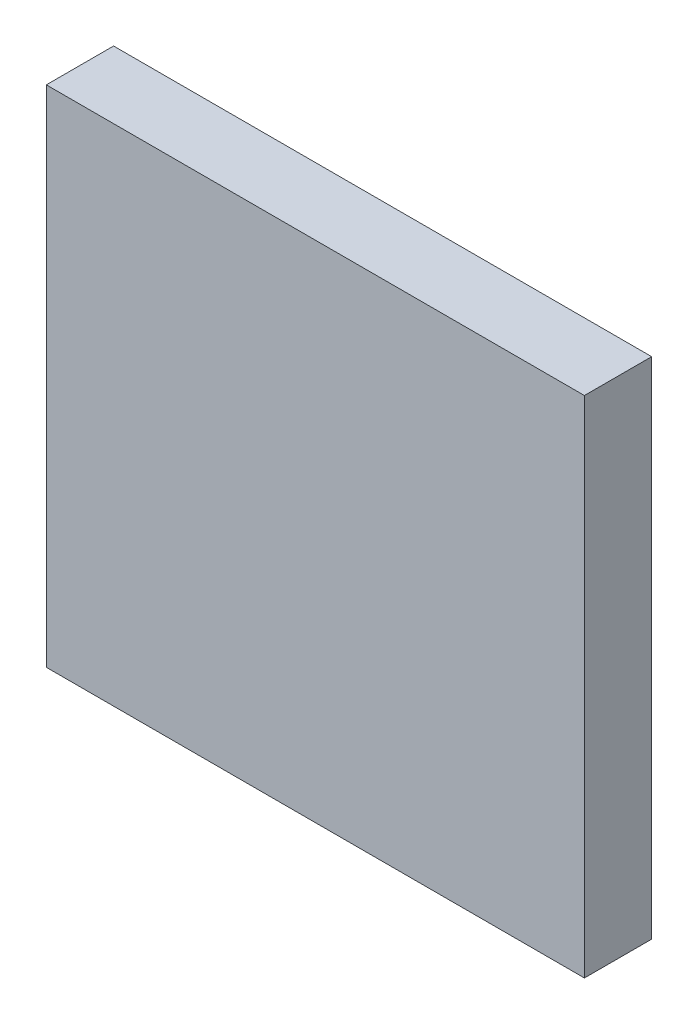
ISO-10303-21;
HEADER;
FILE_DESCRIPTION(('STEP AP214'),'2;1');
FILE_NAME('part.step','',(''),(''),'','','');
FILE_SCHEMA(('AUTOMOTIVE_DESIGN { 1 0 10303 214 1 1 1 1 }'));
ENDSEC;
DATA;
#1=APPLICATION_CONTEXT('core data for automotive mechanical design processes');
#2=APPLICATION_PROTOCOL_DEFINITION('international standard','automotive_design',2000,#1);
#3=PRODUCT_CONTEXT('',#1,'mechanical');
#4=PRODUCT('Part','Part','',(#3));
#5=PRODUCT_RELATED_PRODUCT_CATEGORY('part','',(#4));
#6=PRODUCT_DEFINITION_FORMATION('','',#4);
#7=PRODUCT_DEFINITION_CONTEXT('part definition',#1,'design');
#8=PRODUCT_DEFINITION('design','',#6,#7);
#9=PRODUCT_DEFINITION_SHAPE('','',#8);
#10=(LENGTH_UNIT() NAMED_UNIT(*) SI_UNIT(.MILLI.,.METRE.));
#11=(NAMED_UNIT(*) PLANE_ANGLE_UNIT() SI_UNIT($,.RADIAN.));
#12=(NAMED_UNIT(*) SI_UNIT($,.STERADIAN.) SOLID_ANGLE_UNIT());
#13=UNCERTAINTY_MEASURE_WITH_UNIT(LENGTH_MEASURE(1.E-05),#10,'distance_accuracy_value','');
#14=(GEOMETRIC_REPRESENTATION_CONTEXT(3) GLOBAL_UNCERTAINTY_ASSIGNED_CONTEXT((#13)) GLOBAL_UNIT_ASSIGNED_CONTEXT((#10,
#11,#12)) REPRESENTATION_CONTEXT('',''));
#15=CARTESIAN_POINT('',(0.,0.,0.));
#16=DIRECTION('',(0.,0.,1.));
#17=DIRECTION('',(1.,0.,0.));
#18=AXIS2_PLACEMENT_3D('',#15,#16,#17);
#19=CARTESIAN_POINT('',(0.,0.,6.35));
#20=DIRECTION('',(1.,0.,0.));
#21=DIRECTION('',(0.,0.,-1.));
#22=AXIS2_PLACEMENT_3D('',#19,#20,#21);
#23=PLANE('',#22);
#24=DIRECTION('',(0.,-1.,0.));
#25=VECTOR('',#24,1.);
#26=CARTESIAN_POINT('',(0.,0.,0.));
#27=LINE('',#26,#25);
#28=CARTESIAN_POINT('',(0.,47.625,0.));
#29=VERTEX_POINT('',#28);
#30=CARTESIAN_POINT('',(0.,0.,0.));
#31=VERTEX_POINT('',#30);
#32=EDGE_CURVE('E95',#29,#31,#27,.T.);
#33=ORIENTED_EDGE('',*,*,#32,.T.);
#34=DIRECTION('',(0.,0.,-1.));
#35=VECTOR('',#34,1.);
#36=CARTESIAN_POINT('',(0.,0.,6.35));
#37=LINE('',#36,#35);
#38=CARTESIAN_POINT('',(0.,0.,6.35));
#39=VERTEX_POINT('',#38);
#40=EDGE_CURVE('E11',#39,#31,#37,.T.);
#41=ORIENTED_EDGE('',*,*,#40,.F.);
#42=DIRECTION('',(0.,-1.,0.));
#43=VECTOR('',#42,1.);
#44=CARTESIAN_POINT('',(0.,0.,6.35));
#45=LINE('',#44,#43);
#46=CARTESIAN_POINT('',(0.,47.625,6.35));
#47=VERTEX_POINT('',#46);
#48=EDGE_CURVE('E83',#47,#39,#45,.T.);
#49=ORIENTED_EDGE('',*,*,#48,.F.);
#50=DIRECTION('',(0.,0.,-1.));
#51=VECTOR('',#50,1.);
#52=CARTESIAN_POINT('',(0.,47.625,6.35));
#53=LINE('',#52,#51);
#54=EDGE_CURVE('E91',#47,#29,#53,.T.);
#55=ORIENTED_EDGE('',*,*,#54,.T.);
#56=EDGE_LOOP('',(#33,#41,#49,#55));
#57=FACE_BOUND('',#56,.T.);
#58=ADVANCED_FACE('F32',(#57),#23,.F.);
#59=CARTESIAN_POINT('',(0.,0.,6.35));
#60=DIRECTION('',(0.,1.,0.));
#61=DIRECTION('',(0.,0.,1.));
#62=AXIS2_PLACEMENT_3D('',#59,#60,#61);
#63=PLANE('',#62);
#64=DIRECTION('',(1.,0.,0.));
#65=VECTOR('',#64,1.);
#66=CARTESIAN_POINT('',(0.,0.,0.));
#67=LINE('',#66,#65);
#68=CARTESIAN_POINT('',(50.8,0.,0.));
#69=VERTEX_POINT('',#68);
#70=EDGE_CURVE('E87',#31,#69,#67,.T.);
#71=ORIENTED_EDGE('',*,*,#70,.T.);
#72=DIRECTION('',(0.,0.,-1.));
#73=VECTOR('',#72,1.);
#74=CARTESIAN_POINT('',(50.8,0.,6.35));
#75=LINE('',#74,#73);
#76=CARTESIAN_POINT('',(50.8,0.,6.35));
#77=VERTEX_POINT('',#76);
#78=EDGE_CURVE('E40',#77,#69,#75,.T.);
#79=ORIENTED_EDGE('',*,*,#78,.F.);
#80=DIRECTION('',(1.,0.,0.));
#81=VECTOR('',#80,1.);
#82=CARTESIAN_POINT('',(0.,0.,6.35));
#83=LINE('',#82,#81);
#84=EDGE_CURVE('E78',#39,#77,#83,.T.);
#85=ORIENTED_EDGE('',*,*,#84,.F.);
#86=ORIENTED_EDGE('',*,*,#40,.T.);
#87=EDGE_LOOP('',(#71,#79,#85,#86));
#88=FACE_BOUND('',#87,.T.);
#89=ADVANCED_FACE('F86',(#88),#63,.F.);
#90=CARTESIAN_POINT('',(50.8,0.,6.35));
#91=DIRECTION('',(-1.,0.,0.));
#92=DIRECTION('',(0.,0.,1.));
#93=AXIS2_PLACEMENT_3D('',#90,#91,#92);
#94=PLANE('',#93);
#95=DIRECTION('',(0.,1.,0.));
#96=VECTOR('',#95,1.);
#97=CARTESIAN_POINT('',(50.8,0.,0.));
#98=LINE('',#97,#96);
#99=CARTESIAN_POINT('',(50.8,47.625,0.));
#100=VERTEX_POINT('',#99);
#101=EDGE_CURVE('E65',#69,#100,#98,.T.);
#102=ORIENTED_EDGE('',*,*,#101,.T.);
#103=DIRECTION('',(0.,0.,-1.));
#104=VECTOR('',#103,1.);
#105=CARTESIAN_POINT('',(50.8,47.625,6.35));
#106=LINE('',#105,#104);
#107=CARTESIAN_POINT('',(50.8,47.625,6.35));
#108=VERTEX_POINT('',#107);
#109=EDGE_CURVE('E88',#108,#100,#106,.T.);
#110=ORIENTED_EDGE('',*,*,#109,.F.);
#111=DIRECTION('',(0.,1.,0.));
#112=VECTOR('',#111,1.);
#113=CARTESIAN_POINT('',(50.8,0.,6.35));
#114=LINE('',#113,#112);
#115=EDGE_CURVE('E81',#77,#108,#114,.T.);
#116=ORIENTED_EDGE('',*,*,#115,.F.);
#117=ORIENTED_EDGE('',*,*,#78,.T.);
#118=EDGE_LOOP('',(#102,#110,#116,#117));
#119=FACE_BOUND('',#118,.T.);
#120=ADVANCED_FACE('F89',(#119),#94,.F.);
#121=CARTESIAN_POINT('',(0.,47.625,6.35));
#122=DIRECTION('',(0.,-1.,0.));
#123=DIRECTION('',(0.,0.,-1.));
#124=AXIS2_PLACEMENT_3D('',#121,#122,#123);
#125=PLANE('',#124);
#126=DIRECTION('',(-1.,0.,0.));
#127=VECTOR('',#126,1.);
#128=CARTESIAN_POINT('',(0.,47.625,0.));
#129=LINE('',#128,#127);
#130=EDGE_CURVE('E71',#100,#29,#129,.T.);
#131=ORIENTED_EDGE('',*,*,#130,.T.);
#132=ORIENTED_EDGE('',*,*,#54,.F.);
#133=DIRECTION('',(-1.,0.,0.));
#134=VECTOR('',#133,1.);
#135=CARTESIAN_POINT('',(0.,47.625,6.35));
#136=LINE('',#135,#134);
#137=EDGE_CURVE('E48',#108,#47,#136,.T.);
#138=ORIENTED_EDGE('',*,*,#137,.F.);
#139=ORIENTED_EDGE('',*,*,#109,.T.);
#140=EDGE_LOOP('',(#131,#132,#138,#139));
#141=FACE_BOUND('',#140,.T.);
#142=ADVANCED_FACE('F102',(#141),#125,.F.);
#143=CARTESIAN_POINT('',(0.,0.,6.35));
#144=DIRECTION('',(0.,0.,-1.));
#145=DIRECTION('',(-1.,0.,0.));
#146=AXIS2_PLACEMENT_3D('',#143,#144,#145);
#147=PLANE('',#146);
#148=ORIENTED_EDGE('',*,*,#48,.T.);
#149=ORIENTED_EDGE('',*,*,#84,.T.);
#150=ORIENTED_EDGE('',*,*,#115,.T.);
#151=ORIENTED_EDGE('',*,*,#137,.T.);
#152=EDGE_LOOP('',(#148,#149,#150,#151));
#153=FACE_BOUND('',#152,.T.);
#154=ADVANCED_FACE('F79',(#153),#147,.F.);
#155=CARTESIAN_POINT('',(0.,0.,0.));
#156=DIRECTION('',(0.,0.,-1.));
#157=DIRECTION('',(-1.,0.,0.));
#158=AXIS2_PLACEMENT_3D('',#155,#156,#157);
#159=PLANE('',#158);
#160=ORIENTED_EDGE('',*,*,#32,.F.);
#161=ORIENTED_EDGE('',*,*,#130,.F.);
#162=ORIENTED_EDGE('',*,*,#101,.F.);
#163=ORIENTED_EDGE('',*,*,#70,.F.);
#164=EDGE_LOOP('',(#160,#161,#162,#163));
#165=FACE_BOUND('',#164,.T.);
#166=ADVANCED_FACE('F105',(#165),#159,.T.);
#167=CLOSED_SHELL('',(#58,#89,#120,#142,#154,#166));
#168=MANIFOLD_SOLID_BREP('B2',#167);
#169=ADVANCED_BREP_SHAPE_REPRESENTATION('',(#18,#168),#14);
#170=SHAPE_DEFINITION_REPRESENTATION(#9,#169);
ENDSEC;
END-ISO-10303-21;
